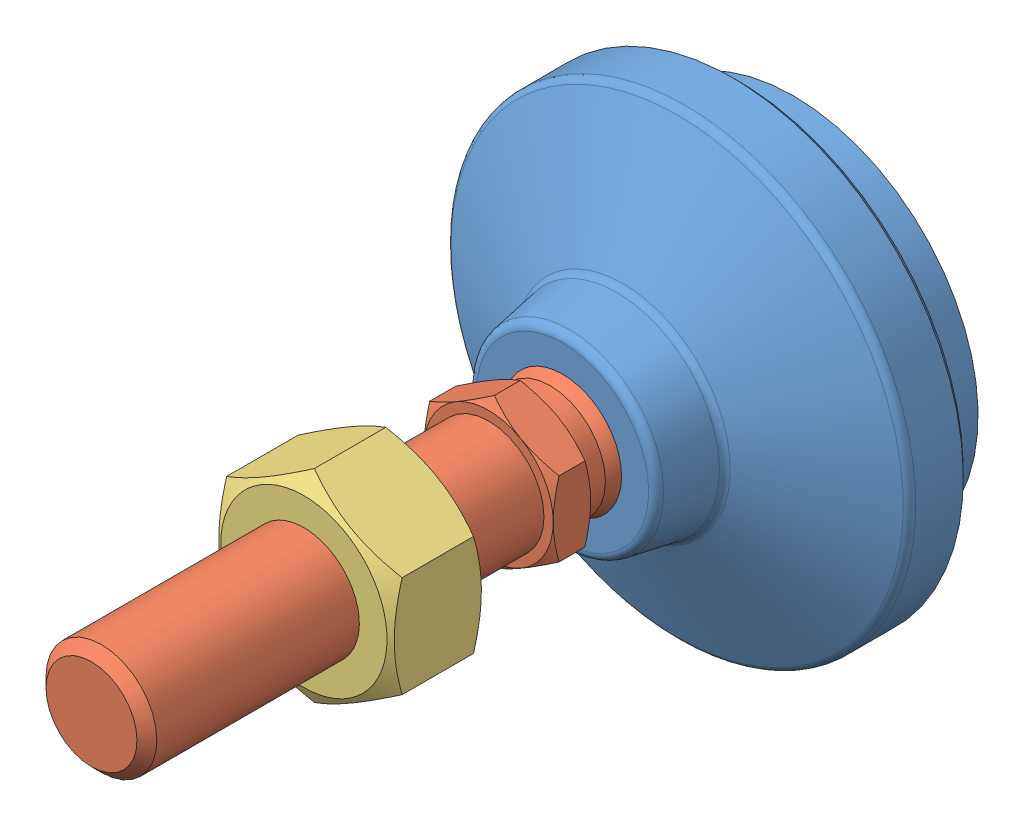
SolidWorks assembly LSVA40-M12X43-SUS.sldasm, configuration Default (file format 15000). Lengths in mm.
Overall size (50 50 76).
3 component instances, 3 part files, 0 mates.
Components (placement in the parent):
- LSVA40-M12X43-SUS_01-1: LSVA40-M12X43-SUS_01.sldprt [Default] at (0 0 6) x (1 0 0) z (0 -1 0) size (50 25 50)
- LSVA40-M12X43-SUS_02-1: LSVA40-M12X43-SUS_02.sldprt [Default] at (0 0 22.15) x (1 0 0) z (0 -1 0) size (14 60.85 16.17)
- LSVA40-M12X43-SUS_03-1: LSVA40-M12X43-SUS_03.sldprt [Default] at (0 0 43) size (19 21.94 10)
